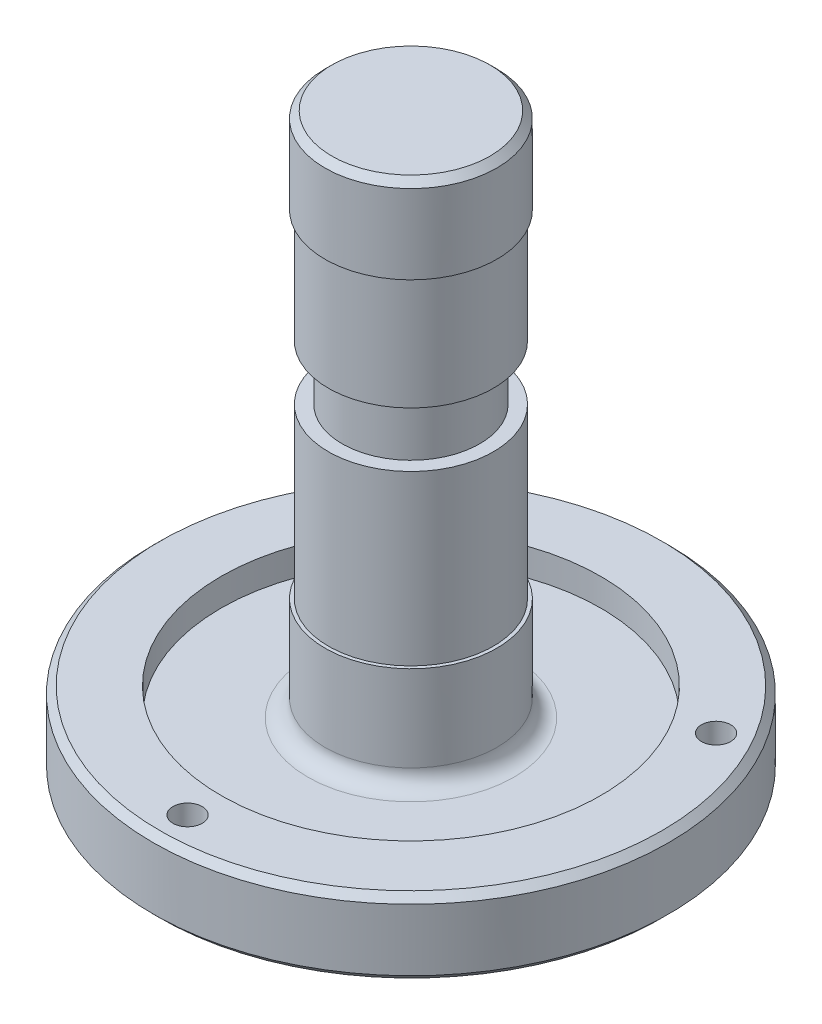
ISO-10303-21;
HEADER;
FILE_DESCRIPTION(('STEP AP214'),'2;1');
FILE_NAME('part.step','',(''),(''),'','','');
FILE_SCHEMA(('AUTOMOTIVE_DESIGN { 1 0 10303 214 1 1 1 1 }'));
ENDSEC;
DATA;
#1=APPLICATION_CONTEXT('core data for automotive mechanical design processes');
#2=APPLICATION_PROTOCOL_DEFINITION('international standard','automotive_design',2000,#1);
#3=PRODUCT_CONTEXT('',#1,'mechanical');
#4=PRODUCT('Part','Part','',(#3));
#5=PRODUCT_RELATED_PRODUCT_CATEGORY('part','',(#4));
#6=PRODUCT_DEFINITION_FORMATION('','',#4);
#7=PRODUCT_DEFINITION_CONTEXT('part definition',#1,'design');
#8=PRODUCT_DEFINITION('design','',#6,#7);
#9=PRODUCT_DEFINITION_SHAPE('','',#8);
#10=(LENGTH_UNIT() NAMED_UNIT(*) SI_UNIT(.MILLI.,.METRE.));
#11=(NAMED_UNIT(*) PLANE_ANGLE_UNIT() SI_UNIT($,.RADIAN.));
#12=(NAMED_UNIT(*) SI_UNIT($,.STERADIAN.) SOLID_ANGLE_UNIT());
#13=UNCERTAINTY_MEASURE_WITH_UNIT(LENGTH_MEASURE(1.E-05),#10,'distance_accuracy_value','');
#14=(GEOMETRIC_REPRESENTATION_CONTEXT(3) GLOBAL_UNCERTAINTY_ASSIGNED_CONTEXT((#13)) GLOBAL_UNIT_ASSIGNED_CONTEXT((#10,
#11,#12)) REPRESENTATION_CONTEXT('',''));
#15=CARTESIAN_POINT('',(0.,0.,0.));
#16=DIRECTION('',(0.,0.,1.));
#17=DIRECTION('',(1.,0.,0.));
#18=AXIS2_PLACEMENT_3D('',#15,#16,#17);
#19=CARTESIAN_POINT('',(0.,0.,0.));
#20=DIRECTION('',(0.,1.,0.));
#21=DIRECTION('',(-1.,0.,0.));
#22=AXIS2_PLACEMENT_3D('',#19,#20,#21);
#23=PLANE('',#22);
#24=CARTESIAN_POINT('',(0.,0.,0.));
#25=DIRECTION('',(0.,1.,0.));
#26=DIRECTION('',(-1.,0.,0.));
#27=AXIS2_PLACEMENT_3D('',#24,#25,#26);
#28=CIRCLE('',#27,32.9);
#29=CARTESIAN_POINT('',(-32.9,0.,0.));
#30=VERTEX_POINT('',#29);
#31=EDGE_CURVE('E45',#30,#30,#28,.F.);
#32=ORIENTED_EDGE('',*,*,#31,.T.);
#33=EDGE_LOOP('',(#32));
#34=FACE_BOUND('',#33,.T.);
#35=ADVANCED_FACE('F34',(#34),#23,.F.);
#36=CARTESIAN_POINT('',(0.,209.604915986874,0.));
#37=DIRECTION('',(0.,1.,0.));
#38=DIRECTION('',(-1.,0.,0.));
#39=AXIS2_PLACEMENT_3D('',#36,#37,#38);
#40=CYLINDRICAL_SURFACE('',#39,34.9);
#41=CARTESIAN_POINT('',(0.,2.00000000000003,0.));
#42=DIRECTION('',(0.,1.,0.));
#43=DIRECTION('',(-1.,0.,0.));
#44=AXIS2_PLACEMENT_3D('',#41,#42,#43);
#45=CIRCLE('',#44,34.9);
#46=CARTESIAN_POINT('',(-34.9,2.00000000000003,0.));
#47=VERTEX_POINT('',#46);
#48=EDGE_CURVE('E49',#47,#47,#45,.T.);
#49=ORIENTED_EDGE('',*,*,#48,.T.);
#50=EDGE_LOOP('',(#49));
#51=FACE_BOUND('',#50,.T.);
#52=CARTESIAN_POINT('',(0.,8.00000000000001,0.));
#53=DIRECTION('',(0.,1.,0.));
#54=DIRECTION('',(-1.,0.,0.));
#55=AXIS2_PLACEMENT_3D('',#52,#53,#54);
#56=CIRCLE('',#55,34.9);
#57=CARTESIAN_POINT('',(-34.9,8.00000000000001,0.));
#58=VERTEX_POINT('',#57);
#59=EDGE_CURVE('E72',#58,#58,#56,.T.);
#60=ORIENTED_EDGE('',*,*,#59,.F.);
#61=EDGE_LOOP('',(#60));
#62=FACE_BOUND('',#61,.T.);
#63=ADVANCED_FACE('F131',(#51,#62),#40,.T.);
#64=CARTESIAN_POINT('',(34.9,8.00000000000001,0.));
#65=DIRECTION('',(0.,1.,0.));
#66=DIRECTION('',(-1.,0.,0.));
#67=AXIS2_PLACEMENT_3D('',#64,#65,#66);
#68=PLANE('',#67);
#69=CARTESIAN_POINT('',(-56.2916512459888,8.00000000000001,-32.4999999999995));
#70=DIRECTION('',(0.,-1.,0.));
#71=DIRECTION('',(0.,0.,-1.));
#72=AXIS2_PLACEMENT_3D('',#69,#70,#71);
#73=CIRCLE('',#72,4.25);
#74=CARTESIAN_POINT('',(-56.2916512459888,8.00000000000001,-36.7499999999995));
#75=VERTEX_POINT('',#74);
#76=EDGE_CURVE('E120',#75,#75,#73,.T.);
#77=ORIENTED_EDGE('',*,*,#76,.F.);
#78=EDGE_LOOP('',(#77));
#79=FACE_BOUND('',#78,.T.);
#80=CARTESIAN_POINT('',(56.2916512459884,8.00000000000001,-32.5000000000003));
#81=DIRECTION('',(0.,-1.,0.));
#82=DIRECTION('',(0.,0.,-1.));
#83=AXIS2_PLACEMENT_3D('',#80,#81,#82);
#84=CIRCLE('',#83,4.25);
#85=CARTESIAN_POINT('',(56.2916512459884,8.00000000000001,-36.7500000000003));
#86=VERTEX_POINT('',#85);
#87=EDGE_CURVE('E114',#86,#86,#84,.T.);
#88=ORIENTED_EDGE('',*,*,#87,.F.);
#89=EDGE_LOOP('',(#88));
#90=FACE_BOUND('',#89,.T.);
#91=CARTESIAN_POINT('',(0.,8.00000000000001,65.));
#92=DIRECTION('',(0.,-1.,0.));
#93=DIRECTION('',(0.,0.,-1.));
#94=AXIS2_PLACEMENT_3D('',#91,#92,#93);
#95=CIRCLE('',#94,4.25);
#96=CARTESIAN_POINT('',(0.,8.00000000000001,60.75));
#97=VERTEX_POINT('',#96);
#98=EDGE_CURVE('E108',#97,#97,#95,.T.);
#99=ORIENTED_EDGE('',*,*,#98,.F.);
#100=EDGE_LOOP('',(#99));
#101=FACE_BOUND('',#100,.T.);
#102=CARTESIAN_POINT('',(0.,8.00000000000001,0.));
#103=DIRECTION('',(0.,1.,0.));
#104=DIRECTION('',(-1.,0.,0.));
#105=AXIS2_PLACEMENT_3D('',#102,#103,#104);
#106=CIRCLE('',#105,73.);
#107=CARTESIAN_POINT('',(-73.,8.00000000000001,0.));
#108=VERTEX_POINT('',#107);
#109=EDGE_CURVE('E63',#108,#108,#106,.F.);
#110=ORIENTED_EDGE('',*,*,#109,.T.);
#111=EDGE_LOOP('',(#110));
#112=FACE_BOUND('',#111,.T.);
#113=ORIENTED_EDGE('',*,*,#59,.T.);
#114=EDGE_LOOP('',(#113));
#115=FACE_BOUND('',#114,.T.);
#116=ADVANCED_FACE('F127',(#79,#90,#101,#112,#115),#68,.F.);
#117=CARTESIAN_POINT('',(0.,209.604915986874,0.));
#118=DIRECTION('',(0.,1.,0.));
#119=DIRECTION('',(-1.,0.,0.));
#120=AXIS2_PLACEMENT_3D('',#117,#118,#119);
#121=CYLINDRICAL_SURFACE('',#120,75.);
#122=CARTESIAN_POINT('',(0.,9.99999999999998,0.));
#123=DIRECTION('',(0.,1.,0.));
#124=DIRECTION('',(-1.,0.,0.));
#125=AXIS2_PLACEMENT_3D('',#122,#123,#124);
#126=CIRCLE('',#125,75.);
#127=CARTESIAN_POINT('',(-75.,9.99999999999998,0.));
#128=VERTEX_POINT('',#127);
#129=EDGE_CURVE('E66',#128,#128,#126,.T.);
#130=ORIENTED_EDGE('',*,*,#129,.T.);
#131=EDGE_LOOP('',(#130));
#132=FACE_BOUND('',#131,.T.);
#133=CARTESIAN_POINT('',(0.,28.,0.));
#134=DIRECTION('',(0.,-1.,0.));
#135=DIRECTION('',(1.,0.,0.));
#136=AXIS2_PLACEMENT_3D('',#133,#134,#135);
#137=CIRCLE('',#136,75.);
#138=CARTESIAN_POINT('',(75.,28.,0.));
#139=VERTEX_POINT('',#138);
#140=EDGE_CURVE('E69',#139,#139,#137,.T.);
#141=ORIENTED_EDGE('',*,*,#140,.T.);
#142=EDGE_LOOP('',(#141));
#143=FACE_BOUND('',#142,.T.);
#144=ADVANCED_FACE('F130',(#132,#143),#121,.T.);
#145=CARTESIAN_POINT('',(55.25,30.,0.));
#146=DIRECTION('',(0.,-1.,0.));
#147=DIRECTION('',(1.,0.,0.));
#148=AXIS2_PLACEMENT_3D('',#145,#146,#147);
#149=PLANE('',#148);
#150=CARTESIAN_POINT('',(-56.2916512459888,30.,-32.4999999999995));
#151=DIRECTION('',(0.,-1.,0.));
#152=DIRECTION('',(1.,0.,0.));
#153=AXIS2_PLACEMENT_3D('',#150,#151,#152);
#154=CIRCLE('',#153,4.25);
#155=CARTESIAN_POINT('',(-52.0416512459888,30.,-32.4999999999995));
#156=VERTEX_POINT('',#155);
#157=EDGE_CURVE('E117',#156,#156,#154,.T.);
#158=ORIENTED_EDGE('',*,*,#157,.T.);
#159=EDGE_LOOP('',(#158));
#160=FACE_BOUND('',#159,.T.);
#161=CARTESIAN_POINT('',(56.2916512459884,30.,-32.5000000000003));
#162=DIRECTION('',(0.,-1.,0.));
#163=DIRECTION('',(1.,0.,0.));
#164=AXIS2_PLACEMENT_3D('',#161,#162,#163);
#165=CIRCLE('',#164,4.25);
#166=CARTESIAN_POINT('',(60.5416512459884,30.,-32.5000000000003));
#167=VERTEX_POINT('',#166);
#168=EDGE_CURVE('E111',#167,#167,#165,.T.);
#169=ORIENTED_EDGE('',*,*,#168,.T.);
#170=EDGE_LOOP('',(#169));
#171=FACE_BOUND('',#170,.T.);
#172=CARTESIAN_POINT('',(0.,30.,65.));
#173=DIRECTION('',(0.,-1.,0.));
#174=DIRECTION('',(1.,0.,0.));
#175=AXIS2_PLACEMENT_3D('',#172,#173,#174);
#176=CIRCLE('',#175,4.25);
#177=CARTESIAN_POINT('',(4.25,30.,65.));
#178=VERTEX_POINT('',#177);
#179=EDGE_CURVE('E105',#178,#178,#176,.T.);
#180=ORIENTED_EDGE('',*,*,#179,.T.);
#181=EDGE_LOOP('',(#180));
#182=FACE_BOUND('',#181,.T.);
#183=CARTESIAN_POINT('',(0.,30.,0.));
#184=DIRECTION('',(0.,-1.,0.));
#185=DIRECTION('',(1.,0.,0.));
#186=AXIS2_PLACEMENT_3D('',#183,#184,#185);
#187=CIRCLE('',#186,73.);
#188=CARTESIAN_POINT('',(73.,30.,0.));
#189=VERTEX_POINT('',#188);
#190=EDGE_CURVE('E60',#189,#189,#187,.F.);
#191=ORIENTED_EDGE('',*,*,#190,.T.);
#192=EDGE_LOOP('',(#191));
#193=FACE_BOUND('',#192,.T.);
#194=CARTESIAN_POINT('',(0.,30.,0.));
#195=DIRECTION('',(0.,1.,0.));
#196=DIRECTION('',(-1.,0.,0.));
#197=AXIS2_PLACEMENT_3D('',#194,#195,#196);
#198=CIRCLE('',#197,55.25);
#199=CARTESIAN_POINT('',(-55.25,30.,0.));
#200=VERTEX_POINT('',#199);
#201=EDGE_CURVE('E75',#200,#200,#198,.T.);
#202=ORIENTED_EDGE('',*,*,#201,.F.);
#203=EDGE_LOOP('',(#202));
#204=FACE_BOUND('',#203,.T.);
#205=ADVANCED_FACE('F233',(#160,#171,#182,#193,#204),#149,.F.);
#206=CARTESIAN_POINT('',(0.,209.604915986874,0.));
#207=DIRECTION('',(0.,1.,0.));
#208=DIRECTION('',(-1.,0.,0.));
#209=AXIS2_PLACEMENT_3D('',#206,#207,#208);
#210=CYLINDRICAL_SURFACE('',#209,55.25);
#211=CARTESIAN_POINT('',(0.,22.,0.));
#212=DIRECTION('',(0.,1.,0.));
#213=DIRECTION('',(-1.,0.,0.));
#214=AXIS2_PLACEMENT_3D('',#211,#212,#213);
#215=CIRCLE('',#214,55.25);
#216=CARTESIAN_POINT('',(-55.25,22.,0.));
#217=VERTEX_POINT('',#216);
#218=EDGE_CURVE('E78',#217,#217,#215,.T.);
#219=ORIENTED_EDGE('',*,*,#218,.F.);
#220=EDGE_LOOP('',(#219));
#221=FACE_BOUND('',#220,.T.);
#222=ORIENTED_EDGE('',*,*,#201,.T.);
#223=EDGE_LOOP('',(#222));
#224=FACE_BOUND('',#223,.T.);
#225=ADVANCED_FACE('F230',(#221,#224),#210,.F.);
#226=CARTESIAN_POINT('',(55.25,22.,0.));
#227=DIRECTION('',(0.,-1.,0.));
#228=DIRECTION('',(1.,0.,0.));
#229=AXIS2_PLACEMENT_3D('',#226,#227,#228);
#230=PLANE('',#229);
#231=CARTESIAN_POINT('',(0.,22.,0.));
#232=DIRECTION('',(0.,-1.,0.));
#233=DIRECTION('',(1.,0.,0.));
#234=AXIS2_PLACEMENT_3D('',#231,#232,#233);
#235=CIRCLE('',#234,30.);
#236=CARTESIAN_POINT('',(30.,22.,0.));
#237=VERTEX_POINT('',#236);
#238=EDGE_CURVE('E10',#237,#237,#235,.T.);
#239=ORIENTED_EDGE('',*,*,#238,.T.);
#240=EDGE_LOOP('',(#239));
#241=FACE_BOUND('',#240,.T.);
#242=ORIENTED_EDGE('',*,*,#218,.T.);
#243=EDGE_LOOP('',(#242));
#244=FACE_BOUND('',#243,.T.);
#245=ADVANCED_FACE('F227',(#241,#244),#230,.F.);
#246=CARTESIAN_POINT('',(0.,209.604915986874,0.));
#247=DIRECTION('',(0.,1.,0.));
#248=DIRECTION('',(-1.,0.,0.));
#249=AXIS2_PLACEMENT_3D('',#246,#247,#248);
#250=CYLINDRICAL_SURFACE('',#249,25.);
#251=CARTESIAN_POINT('',(0.,27.,0.));
#252=DIRECTION('',(0.,-1.,0.));
#253=DIRECTION('',(1.,0.,0.));
#254=AXIS2_PLACEMENT_3D('',#251,#252,#253);
#255=CIRCLE('',#254,25.);
#256=CARTESIAN_POINT('',(25.,27.,0.));
#257=VERTEX_POINT('',#256);
#258=EDGE_CURVE('E41',#257,#257,#255,.F.);
#259=ORIENTED_EDGE('',*,*,#258,.T.);
#260=EDGE_LOOP('',(#259));
#261=FACE_BOUND('',#260,.T.);
#262=CARTESIAN_POINT('',(0.,52.,0.));
#263=DIRECTION('',(0.,1.,0.));
#264=DIRECTION('',(-1.,0.,0.));
#265=AXIS2_PLACEMENT_3D('',#262,#263,#264);
#266=CIRCLE('',#265,25.);
#267=CARTESIAN_POINT('',(-25.,52.,0.));
#268=VERTEX_POINT('',#267);
#269=EDGE_CURVE('E81',#268,#268,#266,.T.);
#270=ORIENTED_EDGE('',*,*,#269,.F.);
#271=EDGE_LOOP('',(#270));
#272=FACE_BOUND('',#271,.T.);
#273=ADVANCED_FACE('F223',(#261,#272),#250,.T.);
#274=CARTESIAN_POINT('',(24.,52.,0.));
#275=DIRECTION('',(0.,-1.,0.));
#276=DIRECTION('',(1.,0.,0.));
#277=AXIS2_PLACEMENT_3D('',#274,#275,#276);
#278=PLANE('',#277);
#279=CARTESIAN_POINT('',(0.,52.,0.));
#280=DIRECTION('',(0.,1.,0.));
#281=DIRECTION('',(-1.,0.,0.));
#282=AXIS2_PLACEMENT_3D('',#279,#280,#281);
#283=CIRCLE('',#282,24.);
#284=CARTESIAN_POINT('',(-24.,52.,0.));
#285=VERTEX_POINT('',#284);
#286=EDGE_CURVE('E84',#285,#285,#283,.T.);
#287=ORIENTED_EDGE('',*,*,#286,.F.);
#288=EDGE_LOOP('',(#287));
#289=FACE_BOUND('',#288,.T.);
#290=ORIENTED_EDGE('',*,*,#269,.T.);
#291=EDGE_LOOP('',(#290));
#292=FACE_BOUND('',#291,.T.);
#293=ADVANCED_FACE('F219',(#289,#292),#278,.F.);
#294=CARTESIAN_POINT('',(0.,209.604915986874,0.));
#295=DIRECTION('',(0.,1.,0.));
#296=DIRECTION('',(-1.,0.,0.));
#297=AXIS2_PLACEMENT_3D('',#294,#295,#296);
#298=CYLINDRICAL_SURFACE('',#297,24.);
#299=CARTESIAN_POINT('',(0.,101.,0.));
#300=DIRECTION('',(0.,1.,0.));
#301=DIRECTION('',(-1.,0.,0.));
#302=AXIS2_PLACEMENT_3D('',#299,#300,#301);
#303=CIRCLE('',#302,24.);
#304=CARTESIAN_POINT('',(-24.,101.,0.));
#305=VERTEX_POINT('',#304);
#306=EDGE_CURVE('E87',#305,#305,#303,.T.);
#307=ORIENTED_EDGE('',*,*,#306,.F.);
#308=EDGE_LOOP('',(#307));
#309=FACE_BOUND('',#308,.T.);
#310=ORIENTED_EDGE('',*,*,#286,.T.);
#311=EDGE_LOOP('',(#310));
#312=FACE_BOUND('',#311,.T.);
#313=ADVANCED_FACE('F215',(#309,#312),#298,.T.);
#314=CARTESIAN_POINT('',(24.,101.,0.));
#315=DIRECTION('',(0.,-1.,0.));
#316=DIRECTION('',(1.,0.,0.));
#317=AXIS2_PLACEMENT_3D('',#314,#315,#316);
#318=PLANE('',#317);
#319=CARTESIAN_POINT('',(0.,101.,0.));
#320=DIRECTION('',(0.,1.,0.));
#321=DIRECTION('',(-1.,0.,0.));
#322=AXIS2_PLACEMENT_3D('',#319,#320,#321);
#323=CIRCLE('',#322,20.);
#324=CARTESIAN_POINT('',(-20.,101.,0.));
#325=VERTEX_POINT('',#324);
#326=EDGE_CURVE('E90',#325,#325,#323,.T.);
#327=ORIENTED_EDGE('',*,*,#326,.F.);
#328=EDGE_LOOP('',(#327));
#329=FACE_BOUND('',#328,.T.);
#330=ORIENTED_EDGE('',*,*,#306,.T.);
#331=EDGE_LOOP('',(#330));
#332=FACE_BOUND('',#331,.T.);
#333=ADVANCED_FACE('F211',(#329,#332),#318,.F.);
#334=CARTESIAN_POINT('',(0.,209.604915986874,0.));
#335=DIRECTION('',(0.,1.,0.));
#336=DIRECTION('',(-1.,0.,0.));
#337=AXIS2_PLACEMENT_3D('',#334,#335,#336);
#338=CYLINDRICAL_SURFACE('',#337,20.);
#339=CARTESIAN_POINT('',(0.,117.,0.));
#340=DIRECTION('',(0.,1.,0.));
#341=DIRECTION('',(-1.,0.,0.));
#342=AXIS2_PLACEMENT_3D('',#339,#340,#341);
#343=CIRCLE('',#342,20.);
#344=CARTESIAN_POINT('',(-20.,117.,0.));
#345=VERTEX_POINT('',#344);
#346=EDGE_CURVE('E93',#345,#345,#343,.T.);
#347=ORIENTED_EDGE('',*,*,#346,.F.);
#348=EDGE_LOOP('',(#347));
#349=FACE_BOUND('',#348,.T.);
#350=ORIENTED_EDGE('',*,*,#326,.T.);
#351=EDGE_LOOP('',(#350));
#352=FACE_BOUND('',#351,.T.);
#353=ADVANCED_FACE('F207',(#349,#352),#338,.T.);
#354=CARTESIAN_POINT('',(24.,117.,0.));
#355=DIRECTION('',(0.,1.,0.));
#356=DIRECTION('',(-1.,0.,0.));
#357=AXIS2_PLACEMENT_3D('',#354,#355,#356);
#358=PLANE('',#357);
#359=CARTESIAN_POINT('',(0.,117.,0.));
#360=DIRECTION('',(0.,1.,0.));
#361=DIRECTION('',(-1.,0.,0.));
#362=AXIS2_PLACEMENT_3D('',#359,#360,#361);
#363=CIRCLE('',#362,24.);
#364=CARTESIAN_POINT('',(-24.,117.,0.));
#365=VERTEX_POINT('',#364);
#366=EDGE_CURVE('E96',#365,#365,#363,.T.);
#367=ORIENTED_EDGE('',*,*,#366,.F.);
#368=EDGE_LOOP('',(#367));
#369=FACE_BOUND('',#368,.T.);
#370=ORIENTED_EDGE('',*,*,#346,.T.);
#371=EDGE_LOOP('',(#370));
#372=FACE_BOUND('',#371,.T.);
#373=ADVANCED_FACE('F203',(#369,#372),#358,.F.);
#374=CARTESIAN_POINT('',(0.,209.604915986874,0.));
#375=DIRECTION('',(0.,1.,0.));
#376=DIRECTION('',(-1.,0.,0.));
#377=AXIS2_PLACEMENT_3D('',#374,#375,#376);
#378=CYLINDRICAL_SURFACE('',#377,24.);
#379=CARTESIAN_POINT('',(0.,150.,0.));
#380=DIRECTION('',(0.,1.,0.));
#381=DIRECTION('',(-1.,0.,0.));
#382=AXIS2_PLACEMENT_3D('',#379,#380,#381);
#383=CIRCLE('',#382,24.);
#384=CARTESIAN_POINT('',(-24.,150.,0.));
#385=VERTEX_POINT('',#384);
#386=EDGE_CURVE('E99',#385,#385,#383,.T.);
#387=ORIENTED_EDGE('',*,*,#386,.F.);
#388=EDGE_LOOP('',(#387));
#389=FACE_BOUND('',#388,.T.);
#390=ORIENTED_EDGE('',*,*,#366,.T.);
#391=EDGE_LOOP('',(#390));
#392=FACE_BOUND('',#391,.T.);
#393=ADVANCED_FACE('F199',(#389,#392),#378,.T.);
#394=CARTESIAN_POINT('',(24.,150.,0.));
#395=DIRECTION('',(0.,1.,0.));
#396=DIRECTION('',(-1.,0.,0.));
#397=AXIS2_PLACEMENT_3D('',#394,#395,#396);
#398=PLANE('',#397);
#399=CARTESIAN_POINT('',(0.,150.,0.));
#400=DIRECTION('',(0.,1.,0.));
#401=DIRECTION('',(-1.,0.,0.));
#402=AXIS2_PLACEMENT_3D('',#399,#400,#401);
#403=CIRCLE('',#402,25.);
#404=CARTESIAN_POINT('',(-25.,150.,0.));
#405=VERTEX_POINT('',#404);
#406=EDGE_CURVE('E102',#405,#405,#403,.T.);
#407=ORIENTED_EDGE('',*,*,#406,.F.);
#408=EDGE_LOOP('',(#407));
#409=FACE_BOUND('',#408,.T.);
#410=ORIENTED_EDGE('',*,*,#386,.T.);
#411=EDGE_LOOP('',(#410));
#412=FACE_BOUND('',#411,.T.);
#413=ADVANCED_FACE('F195',(#409,#412),#398,.F.);
#414=CARTESIAN_POINT('',(0.,209.604915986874,0.));
#415=DIRECTION('',(0.,1.,0.));
#416=DIRECTION('',(-1.,0.,0.));
#417=AXIS2_PLACEMENT_3D('',#414,#415,#416);
#418=CYLINDRICAL_SURFACE('',#417,25.);
#419=CARTESIAN_POINT('',(0.,173.,0.));
#420=DIRECTION('',(0.,-1.,0.));
#421=DIRECTION('',(1.,0.,0.));
#422=AXIS2_PLACEMENT_3D('',#419,#420,#421);
#423=CIRCLE('',#422,25.);
#424=CARTESIAN_POINT('',(25.,173.,0.));
#425=VERTEX_POINT('',#424);
#426=EDGE_CURVE('E54',#425,#425,#423,.T.);
#427=ORIENTED_EDGE('',*,*,#426,.T.);
#428=EDGE_LOOP('',(#427));
#429=FACE_BOUND('',#428,.T.);
#430=ORIENTED_EDGE('',*,*,#406,.T.);
#431=EDGE_LOOP('',(#430));
#432=FACE_BOUND('',#431,.T.);
#433=ADVANCED_FACE('F191',(#429,#432),#418,.T.);
#434=CARTESIAN_POINT('',(0.,175.,0.));
#435=DIRECTION('',(0.,-1.,0.));
#436=DIRECTION('',(1.,0.,0.));
#437=AXIS2_PLACEMENT_3D('',#434,#435,#436);
#438=PLANE('',#437);
#439=CARTESIAN_POINT('',(0.,175.,0.));
#440=DIRECTION('',(0.,-1.,0.));
#441=DIRECTION('',(1.,0.,0.));
#442=AXIS2_PLACEMENT_3D('',#439,#440,#441);
#443=CIRCLE('',#442,23.);
#444=CARTESIAN_POINT('',(23.,175.,0.));
#445=VERTEX_POINT('',#444);
#446=EDGE_CURVE('E57',#445,#445,#443,.F.);
#447=ORIENTED_EDGE('',*,*,#446,.T.);
#448=EDGE_LOOP('',(#447));
#449=FACE_BOUND('',#448,.T.);
#450=ADVANCED_FACE('F155',(#449),#438,.F.);
#451=CARTESIAN_POINT('',(0.,9.99999999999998,0.));
#452=DIRECTION('',(0.,1.,0.));
#453=DIRECTION('',(-1.,0.,0.));
#454=AXIS2_PLACEMENT_3D('',#451,#452,#453);
#455=CONICAL_SURFACE('',#454,75.,0.785398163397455);
#456=ORIENTED_EDGE('',*,*,#109,.F.);
#457=EDGE_LOOP('',(#456));
#458=FACE_BOUND('',#457,.T.);
#459=ORIENTED_EDGE('',*,*,#129,.F.);
#460=EDGE_LOOP('',(#459));
#461=FACE_BOUND('',#460,.T.);
#462=ADVANCED_FACE('F151',(#458,#461),#455,.T.);
#463=CARTESIAN_POINT('',(0.,30.,0.));
#464=DIRECTION('',(0.,-1.,0.));
#465=DIRECTION('',(1.,0.,0.));
#466=AXIS2_PLACEMENT_3D('',#463,#464,#465);
#467=CONICAL_SURFACE('',#466,73.,0.785398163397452);
#468=ORIENTED_EDGE('',*,*,#140,.F.);
#469=EDGE_LOOP('',(#468));
#470=FACE_BOUND('',#469,.T.);
#471=ORIENTED_EDGE('',*,*,#190,.F.);
#472=EDGE_LOOP('',(#471));
#473=FACE_BOUND('',#472,.T.);
#474=ADVANCED_FACE('F154',(#470,#473),#467,.T.);
#475=CARTESIAN_POINT('',(0.,175.,0.));
#476=DIRECTION('',(0.,-1.,0.));
#477=DIRECTION('',(1.,0.,0.));
#478=AXIS2_PLACEMENT_3D('',#475,#476,#477);
#479=CONICAL_SURFACE('',#478,23.,0.785398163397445);
#480=ORIENTED_EDGE('',*,*,#426,.F.);
#481=EDGE_LOOP('',(#480));
#482=FACE_BOUND('',#481,.T.);
#483=ORIENTED_EDGE('',*,*,#446,.F.);
#484=EDGE_LOOP('',(#483));
#485=FACE_BOUND('',#484,.T.);
#486=ADVANCED_FACE('F159',(#482,#485),#479,.T.);
#487=CARTESIAN_POINT('',(0.,2.00000000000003,0.));
#488=DIRECTION('',(0.,1.,0.));
#489=DIRECTION('',(-1.,0.,0.));
#490=AXIS2_PLACEMENT_3D('',#487,#488,#489);
#491=CONICAL_SURFACE('',#490,34.9,0.785398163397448);
#492=ORIENTED_EDGE('',*,*,#31,.F.);
#493=EDGE_LOOP('',(#492));
#494=FACE_BOUND('',#493,.T.);
#495=ORIENTED_EDGE('',*,*,#48,.F.);
#496=EDGE_LOOP('',(#495));
#497=FACE_BOUND('',#496,.T.);
#498=ADVANCED_FACE('F162',(#494,#497),#491,.T.);
#499=CARTESIAN_POINT('',(0.,27.,0.));
#500=DIRECTION('',(0.,-1.,0.));
#501=DIRECTION('',(1.,0.,0.));
#502=AXIS2_PLACEMENT_3D('',#499,#500,#501);
#503=TOROIDAL_SURFACE('',#502,30.,5.);
#504=ORIENTED_EDGE('',*,*,#238,.F.);
#505=EDGE_LOOP('',(#504));
#506=FACE_BOUND('',#505,.T.);
#507=ORIENTED_EDGE('',*,*,#258,.F.);
#508=EDGE_LOOP('',(#507));
#509=FACE_BOUND('',#508,.T.);
#510=ADVANCED_FACE('F36',(#506,#509),#503,.F.);
#511=CARTESIAN_POINT('',(0.,8.00000000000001,65.));
#512=DIRECTION('',(0.,-1.,0.));
#513=DIRECTION('',(0.,0.,-1.));
#514=AXIS2_PLACEMENT_3D('',#511,#512,#513);
#515=CYLINDRICAL_SURFACE('',#514,4.25);
#516=ORIENTED_EDGE('',*,*,#98,.T.);
#517=EDGE_LOOP('',(#516));
#518=FACE_BOUND('',#517,.T.);
#519=ORIENTED_EDGE('',*,*,#179,.F.);
#520=EDGE_LOOP('',(#519));
#521=FACE_BOUND('',#520,.T.);
#522=ADVANCED_FACE('F169',(#518,#521),#515,.F.);
#523=CARTESIAN_POINT('',(56.2916512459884,8.00000000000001,-32.5000000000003));
#524=DIRECTION('',(0.,-1.,0.));
#525=DIRECTION('',(0.,0.,-1.));
#526=AXIS2_PLACEMENT_3D('',#523,#524,#525);
#527=CYLINDRICAL_SURFACE('',#526,4.25);
#528=ORIENTED_EDGE('',*,*,#87,.T.);
#529=EDGE_LOOP('',(#528));
#530=FACE_BOUND('',#529,.T.);
#531=ORIENTED_EDGE('',*,*,#168,.F.);
#532=EDGE_LOOP('',(#531));
#533=FACE_BOUND('',#532,.T.);
#534=ADVANCED_FACE('F177',(#530,#533),#527,.F.);
#535=CARTESIAN_POINT('',(-56.2916512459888,8.00000000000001,-32.4999999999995));
#536=DIRECTION('',(0.,-1.,0.));
#537=DIRECTION('',(0.,0.,-1.));
#538=AXIS2_PLACEMENT_3D('',#535,#536,#537);
#539=CYLINDRICAL_SURFACE('',#538,4.25);
#540=ORIENTED_EDGE('',*,*,#76,.T.);
#541=EDGE_LOOP('',(#540));
#542=FACE_BOUND('',#541,.T.);
#543=ORIENTED_EDGE('',*,*,#157,.F.);
#544=EDGE_LOOP('',(#543));
#545=FACE_BOUND('',#544,.T.);
#546=ADVANCED_FACE('F124',(#542,#545),#539,.F.);
#547=CLOSED_SHELL('',(#35,#63,#116,#144,#205,#225,#245,#273,#293,#313,#333,#353,#373,#393,#413,
#433,#450,#462,#474,#486,#498,#510,#522,#534,#546));
#548=MANIFOLD_SOLID_BREP('B2',#547);
#549=ADVANCED_BREP_SHAPE_REPRESENTATION('',(#18,#548),#14);
#550=SHAPE_DEFINITION_REPRESENTATION(#9,#549);
ENDSEC;
END-ISO-10303-21;
